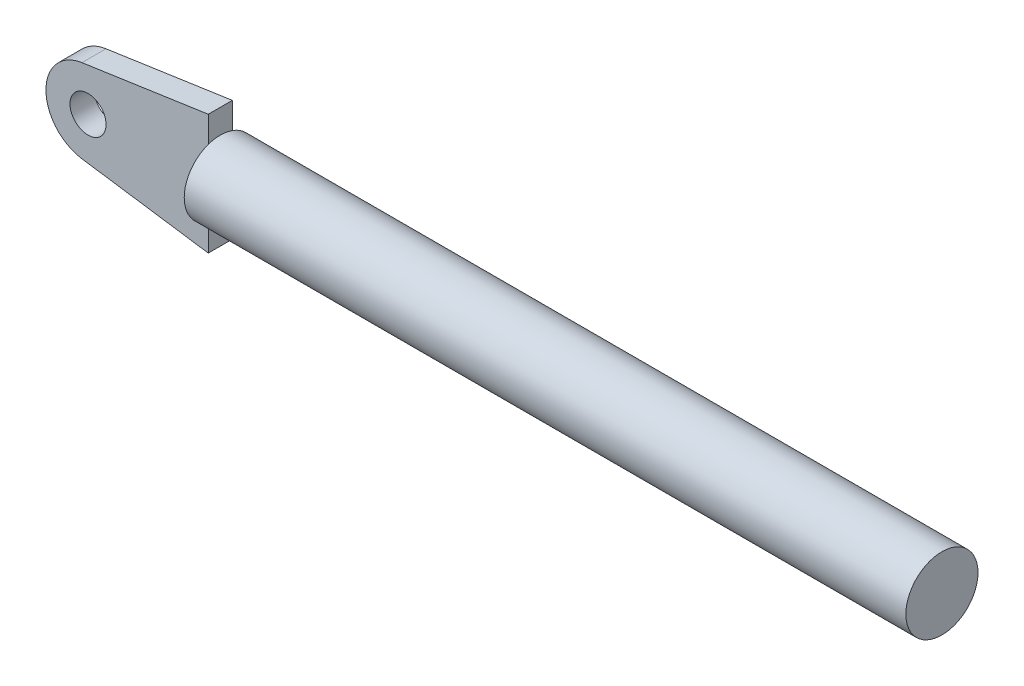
ISO-10303-21;
HEADER;
FILE_DESCRIPTION(('STEP AP214'),'2;1');
FILE_NAME('part.step','',(''),(''),'','','');
FILE_SCHEMA(('AUTOMOTIVE_DESIGN { 1 0 10303 214 1 1 1 1 }'));
ENDSEC;
DATA;
#1=APPLICATION_CONTEXT('core data for automotive mechanical design processes');
#2=APPLICATION_PROTOCOL_DEFINITION('international standard','automotive_design',2000,#1);
#3=PRODUCT_CONTEXT('',#1,'mechanical');
#4=PRODUCT('Part','Part','',(#3));
#5=PRODUCT_RELATED_PRODUCT_CATEGORY('part','',(#4));
#6=PRODUCT_DEFINITION_FORMATION('','',#4);
#7=PRODUCT_DEFINITION_CONTEXT('part definition',#1,'design');
#8=PRODUCT_DEFINITION('design','',#6,#7);
#9=PRODUCT_DEFINITION_SHAPE('','',#8);
#10=(LENGTH_UNIT() NAMED_UNIT(*) SI_UNIT(.MILLI.,.METRE.));
#11=(NAMED_UNIT(*) PLANE_ANGLE_UNIT() SI_UNIT($,.RADIAN.));
#12=(NAMED_UNIT(*) SI_UNIT($,.STERADIAN.) SOLID_ANGLE_UNIT());
#13=UNCERTAINTY_MEASURE_WITH_UNIT(LENGTH_MEASURE(1.E-05),#10,'distance_accuracy_value','');
#14=(GEOMETRIC_REPRESENTATION_CONTEXT(3) GLOBAL_UNCERTAINTY_ASSIGNED_CONTEXT((#13)) GLOBAL_UNIT_ASSIGNED_CONTEXT((#10,
#11,#12)) REPRESENTATION_CONTEXT('',''));
#15=CARTESIAN_POINT('',(0.,0.,0.));
#16=DIRECTION('',(0.,0.,1.));
#17=DIRECTION('',(1.,0.,0.));
#18=AXIS2_PLACEMENT_3D('',#15,#16,#17);
#19=CARTESIAN_POINT('',(0.,0.,0.));
#20=DIRECTION('',(1.,0.,0.));
#21=DIRECTION('',(0.,0.,-1.));
#22=AXIS2_PLACEMENT_3D('',#19,#20,#21);
#23=PLANE('',#22);
#24=DIRECTION('',(0.,1.,0.));
#25=VECTOR('',#24,1.);
#26=CARTESIAN_POINT('',(0.,-50.,10.));
#27=LINE('',#26,#25);
#28=CARTESIAN_POINT('',(0.,-28.2842712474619,10.));
#29=VERTEX_POINT('',#28);
#30=CARTESIAN_POINT('',(0.,28.2842712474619,10.));
#31=VERTEX_POINT('',#30);
#32=EDGE_CURVE('E42',#29,#31,#27,.T.);
#33=ORIENTED_EDGE('',*,*,#32,.F.);
#34=CARTESIAN_POINT('',(0.,0.,0.));
#35=DIRECTION('',(1.,0.,0.));
#36=DIRECTION('',(0.,0.,-1.));
#37=AXIS2_PLACEMENT_3D('',#34,#35,#36);
#38=CIRCLE('',#37,30.);
#39=EDGE_CURVE('E125',#31,#29,#38,.T.);
#40=ORIENTED_EDGE('',*,*,#39,.F.);
#41=EDGE_LOOP('',(#33,#40));
#42=FACE_BOUND('',#41,.T.);
#43=ADVANCED_FACE('F33',(#42),#23,.F.);
#44=CARTESIAN_POINT('',(600.,0.,0.));
#45=DIRECTION('',(-1.,0.,0.));
#46=DIRECTION('',(0.,0.,1.));
#47=AXIS2_PLACEMENT_3D('',#44,#45,#46);
#48=CYLINDRICAL_SURFACE('',#47,30.);
#49=CARTESIAN_POINT('',(600.,0.,0.));
#50=DIRECTION('',(1.,0.,0.));
#51=DIRECTION('',(0.,0.,-1.));
#52=AXIS2_PLACEMENT_3D('',#49,#50,#51);
#53=CIRCLE('',#52,30.);
#54=CARTESIAN_POINT('',(600.,0.,-30.));
#55=VERTEX_POINT('',#54);
#56=EDGE_CURVE('E119',#55,#55,#53,.T.);
#57=ORIENTED_EDGE('',*,*,#56,.F.);
#58=EDGE_LOOP('',(#57));
#59=FACE_BOUND('',#58,.T.);
#60=CARTESIAN_POINT('',(0.,28.2842712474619,-10.));
#61=VERTEX_POINT('',#60);
#62=EDGE_CURVE('E37',#61,#31,#38,.T.);
#63=ORIENTED_EDGE('',*,*,#62,.T.);
#64=ORIENTED_EDGE('',*,*,#39,.T.);
#65=CARTESIAN_POINT('',(0.,-28.2842712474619,-10.));
#66=VERTEX_POINT('',#65);
#67=EDGE_CURVE('E115',#29,#66,#38,.T.);
#68=ORIENTED_EDGE('',*,*,#67,.T.);
#69=EDGE_CURVE('E50',#66,#61,#38,.T.);
#70=ORIENTED_EDGE('',*,*,#69,.T.);
#71=EDGE_LOOP('',(#63,#64,#68,#70));
#72=FACE_BOUND('',#71,.T.);
#73=ADVANCED_FACE('F35',(#59,#72),#48,.T.);
#74=CARTESIAN_POINT('',(600.,0.,0.));
#75=DIRECTION('',(1.,0.,0.));
#76=DIRECTION('',(0.,0.,-1.));
#77=AXIS2_PLACEMENT_3D('',#74,#75,#76);
#78=PLANE('',#77);
#79=ORIENTED_EDGE('',*,*,#56,.T.);
#80=EDGE_LOOP('',(#79));
#81=FACE_BOUND('',#80,.T.);
#82=ADVANCED_FACE('F169',(#81),#78,.T.);
#83=ORIENTED_EDGE('',*,*,#69,.F.);
#84=DIRECTION('',(0.,1.,0.));
#85=VECTOR('',#84,1.);
#86=CARTESIAN_POINT('',(0.,-50.,-10.));
#87=LINE('',#86,#85);
#88=EDGE_CURVE('E11',#66,#61,#87,.T.);
#89=ORIENTED_EDGE('',*,*,#88,.T.);
#90=EDGE_LOOP('',(#83,#89));
#91=FACE_BOUND('',#90,.T.);
#92=ADVANCED_FACE('F165',(#91),#23,.F.);
#93=CARTESIAN_POINT('',(0.,-50.,10.));
#94=DIRECTION('',(-1.,0.,0.));
#95=DIRECTION('',(0.,-1.,0.));
#96=AXIS2_PLACEMENT_3D('',#93,#94,#95);
#97=PLANE('',#96);
#98=ORIENTED_EDGE('',*,*,#62,.F.);
#99=CARTESIAN_POINT('',(0.,50.,-10.));
#100=VERTEX_POINT('',#99);
#101=EDGE_CURVE('E45',#61,#100,#87,.T.);
#102=ORIENTED_EDGE('',*,*,#101,.T.);
#103=DIRECTION('',(0.,0.,-1.));
#104=VECTOR('',#103,1.);
#105=CARTESIAN_POINT('',(0.,50.,10.));
#106=LINE('',#105,#104);
#107=CARTESIAN_POINT('',(0.,50.,10.));
#108=VERTEX_POINT('',#107);
#109=EDGE_CURVE('E147',#108,#100,#106,.T.);
#110=ORIENTED_EDGE('',*,*,#109,.F.);
#111=EDGE_CURVE('E106',#31,#108,#27,.T.);
#112=ORIENTED_EDGE('',*,*,#111,.F.);
#113=EDGE_LOOP('',(#98,#102,#110,#112));
#114=FACE_BOUND('',#113,.T.);
#115=ADVANCED_FACE('F162',(#114),#97,.F.);
#116=CARTESIAN_POINT('',(-100.,0.,10.));
#117=DIRECTION('',(0.,0.,1.));
#118=DIRECTION('',(1.,0.,0.));
#119=AXIS2_PLACEMENT_3D('',#116,#117,#118);
#120=PLANE('',#119);
#121=DIRECTION('',(-0.989470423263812,-0.144735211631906,0.));
#122=VECTOR('',#121,1.);
#123=CARTESIAN_POINT('',(0.,50.,10.));
#124=LINE('',#123,#122);
#125=CARTESIAN_POINT('',(-105.065732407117,34.6314648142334,10.));
#126=VERTEX_POINT('',#125);
#127=EDGE_CURVE('E100',#108,#126,#124,.T.);
#128=ORIENTED_EDGE('',*,*,#127,.T.);
#129=CARTESIAN_POINT('',(-100.,0.,10.));
#130=DIRECTION('',(0.,0.,1.));
#131=DIRECTION('',(1.,0.,0.));
#132=AXIS2_PLACEMENT_3D('',#129,#130,#131);
#133=CIRCLE('',#132,35.);
#134=CARTESIAN_POINT('',(-105.065732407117,-34.6314648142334,10.));
#135=VERTEX_POINT('',#134);
#136=EDGE_CURVE('E89',#126,#135,#133,.T.);
#137=ORIENTED_EDGE('',*,*,#136,.T.);
#138=DIRECTION('',(0.989470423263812,-0.144735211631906,0.));
#139=VECTOR('',#138,1.);
#140=CARTESIAN_POINT('',(0.,-50.,10.));
#141=LINE('',#140,#139);
#142=CARTESIAN_POINT('',(0.,-50.,10.));
#143=VERTEX_POINT('',#142);
#144=EDGE_CURVE('E99',#135,#143,#141,.T.);
#145=ORIENTED_EDGE('',*,*,#144,.T.);
#146=EDGE_CURVE('E124',#143,#29,#27,.T.);
#147=ORIENTED_EDGE('',*,*,#146,.T.);
#148=ORIENTED_EDGE('',*,*,#32,.T.);
#149=ORIENTED_EDGE('',*,*,#111,.T.);
#150=EDGE_LOOP('',(#128,#137,#145,#147,#148,#149));
#151=FACE_BOUND('',#150,.T.);
#152=CARTESIAN_POINT('',(-100.,0.,10.));
#153=DIRECTION('',(0.,0.,1.));
#154=DIRECTION('',(1.,0.,0.));
#155=AXIS2_PLACEMENT_3D('',#152,#153,#154);
#156=CIRCLE('',#155,15.);
#157=CARTESIAN_POINT('',(-85.,0.,10.));
#158=VERTEX_POINT('',#157);
#159=EDGE_CURVE('E151',#158,#158,#156,.T.);
#160=ORIENTED_EDGE('',*,*,#159,.F.);
#161=EDGE_LOOP('',(#160));
#162=FACE_BOUND('',#161,.T.);
#163=ADVANCED_FACE('F103',(#151,#162),#120,.T.);
#164=CARTESIAN_POINT('',(-100.,0.,-10.));
#165=DIRECTION('',(0.,0.,1.));
#166=DIRECTION('',(1.,0.,0.));
#167=AXIS2_PLACEMENT_3D('',#164,#165,#166);
#168=PLANE('',#167);
#169=DIRECTION('',(-0.989470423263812,-0.144735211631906,0.));
#170=VECTOR('',#169,1.);
#171=CARTESIAN_POINT('',(0.,50.,-10.));
#172=LINE('',#171,#170);
#173=CARTESIAN_POINT('',(-105.065732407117,34.6314648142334,-10.));
#174=VERTEX_POINT('',#173);
#175=EDGE_CURVE('E113',#100,#174,#172,.T.);
#176=ORIENTED_EDGE('',*,*,#175,.F.);
#177=ORIENTED_EDGE('',*,*,#101,.F.);
#178=ORIENTED_EDGE('',*,*,#88,.F.);
#179=CARTESIAN_POINT('',(0.,-50.,-10.));
#180=VERTEX_POINT('',#179);
#181=EDGE_CURVE('E44',#180,#66,#87,.T.);
#182=ORIENTED_EDGE('',*,*,#181,.F.);
#183=DIRECTION('',(0.989470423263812,-0.144735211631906,0.));
#184=VECTOR('',#183,1.);
#185=CARTESIAN_POINT('',(0.,-50.,-10.));
#186=LINE('',#185,#184);
#187=CARTESIAN_POINT('',(-105.065732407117,-34.6314648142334,-10.));
#188=VERTEX_POINT('',#187);
#189=EDGE_CURVE('E143',#188,#180,#186,.T.);
#190=ORIENTED_EDGE('',*,*,#189,.F.);
#191=CARTESIAN_POINT('',(-100.,0.,-10.));
#192=DIRECTION('',(0.,0.,1.));
#193=DIRECTION('',(1.,0.,0.));
#194=AXIS2_PLACEMENT_3D('',#191,#192,#193);
#195=CIRCLE('',#194,35.);
#196=EDGE_CURVE('E150',#174,#188,#195,.T.);
#197=ORIENTED_EDGE('',*,*,#196,.F.);
#198=EDGE_LOOP('',(#176,#177,#178,#182,#190,#197));
#199=FACE_BOUND('',#198,.T.);
#200=CARTESIAN_POINT('',(-100.,0.,-10.));
#201=DIRECTION('',(0.,0.,1.));
#202=DIRECTION('',(1.,0.,0.));
#203=AXIS2_PLACEMENT_3D('',#200,#201,#202);
#204=CIRCLE('',#203,15.);
#205=CARTESIAN_POINT('',(-85.,0.,-10.));
#206=VERTEX_POINT('',#205);
#207=EDGE_CURVE('E200',#206,#206,#204,.T.);
#208=ORIENTED_EDGE('',*,*,#207,.T.);
#209=EDGE_LOOP('',(#208));
#210=FACE_BOUND('',#209,.T.);
#211=ADVANCED_FACE('F137',(#199,#210),#168,.F.);
#212=CARTESIAN_POINT('',(0.,50.,10.));
#213=DIRECTION('',(0.144735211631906,-0.989470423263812,0.));
#214=DIRECTION('',(0.989470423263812,0.144735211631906,0.));
#215=AXIS2_PLACEMENT_3D('',#212,#213,#214);
#216=PLANE('',#215);
#217=ORIENTED_EDGE('',*,*,#175,.T.);
#218=DIRECTION('',(0.,0.,-1.));
#219=VECTOR('',#218,1.);
#220=CARTESIAN_POINT('',(-105.065732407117,34.6314648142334,10.));
#221=LINE('',#220,#219);
#222=EDGE_CURVE('E93',#126,#174,#221,.T.);
#223=ORIENTED_EDGE('',*,*,#222,.F.);
#224=ORIENTED_EDGE('',*,*,#127,.F.);
#225=ORIENTED_EDGE('',*,*,#109,.T.);
#226=EDGE_LOOP('',(#217,#223,#224,#225));
#227=FACE_BOUND('',#226,.T.);
#228=ADVANCED_FACE('F111',(#227),#216,.F.);
#229=CARTESIAN_POINT('',(-100.,0.,10.));
#230=DIRECTION('',(0.,0.,-1.));
#231=DIRECTION('',(-1.,0.,0.));
#232=AXIS2_PLACEMENT_3D('',#229,#230,#231);
#233=CYLINDRICAL_SURFACE('',#232,35.);
#234=ORIENTED_EDGE('',*,*,#196,.T.);
#235=DIRECTION('',(0.,0.,-1.));
#236=VECTOR('',#235,1.);
#237=CARTESIAN_POINT('',(-105.065732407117,-34.6314648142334,10.));
#238=LINE('',#237,#236);
#239=EDGE_CURVE('E96',#135,#188,#238,.T.);
#240=ORIENTED_EDGE('',*,*,#239,.F.);
#241=ORIENTED_EDGE('',*,*,#136,.F.);
#242=ORIENTED_EDGE('',*,*,#222,.T.);
#243=EDGE_LOOP('',(#234,#240,#241,#242));
#244=FACE_BOUND('',#243,.T.);
#245=ADVANCED_FACE('F91',(#244),#233,.T.);
#246=CARTESIAN_POINT('',(0.,-50.,10.));
#247=DIRECTION('',(0.144735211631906,0.989470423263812,0.));
#248=DIRECTION('',(-0.989470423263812,0.144735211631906,0.));
#249=AXIS2_PLACEMENT_3D('',#246,#247,#248);
#250=PLANE('',#249);
#251=ORIENTED_EDGE('',*,*,#189,.T.);
#252=DIRECTION('',(0.,0.,-1.));
#253=VECTOR('',#252,1.);
#254=CARTESIAN_POINT('',(0.,-50.,10.));
#255=LINE('',#254,#253);
#256=EDGE_CURVE('E116',#143,#180,#255,.T.);
#257=ORIENTED_EDGE('',*,*,#256,.F.);
#258=ORIENTED_EDGE('',*,*,#144,.F.);
#259=ORIENTED_EDGE('',*,*,#239,.T.);
#260=EDGE_LOOP('',(#251,#257,#258,#259));
#261=FACE_BOUND('',#260,.T.);
#262=ADVANCED_FACE('F153',(#261),#250,.F.);
#263=ORIENTED_EDGE('',*,*,#67,.F.);
#264=ORIENTED_EDGE('',*,*,#146,.F.);
#265=ORIENTED_EDGE('',*,*,#256,.T.);
#266=ORIENTED_EDGE('',*,*,#181,.T.);
#267=EDGE_LOOP('',(#263,#264,#265,#266));
#268=FACE_BOUND('',#267,.T.);
#269=ADVANCED_FACE('F141',(#268),#97,.F.);
#270=CARTESIAN_POINT('',(-100.,0.,10.));
#271=DIRECTION('',(0.,0.,-1.));
#272=DIRECTION('',(-1.,0.,0.));
#273=AXIS2_PLACEMENT_3D('',#270,#271,#272);
#274=CYLINDRICAL_SURFACE('',#273,15.);
#275=ORIENTED_EDGE('',*,*,#159,.T.);
#276=EDGE_LOOP('',(#275));
#277=FACE_BOUND('',#276,.T.);
#278=ORIENTED_EDGE('',*,*,#207,.F.);
#279=EDGE_LOOP('',(#278));
#280=FACE_BOUND('',#279,.T.);
#281=ADVANCED_FACE('F160',(#277,#280),#274,.F.);
#282=CLOSED_SHELL('',(#43,#73,#82,#92,#115,#163,#211,#228,#245,#262,#269,#281));
#283=MANIFOLD_SOLID_BREP('B2',#282);
#284=ADVANCED_BREP_SHAPE_REPRESENTATION('',(#18,#283),#14);
#285=SHAPE_DEFINITION_REPRESENTATION(#9,#284);
ENDSEC;
END-ISO-10303-21;
